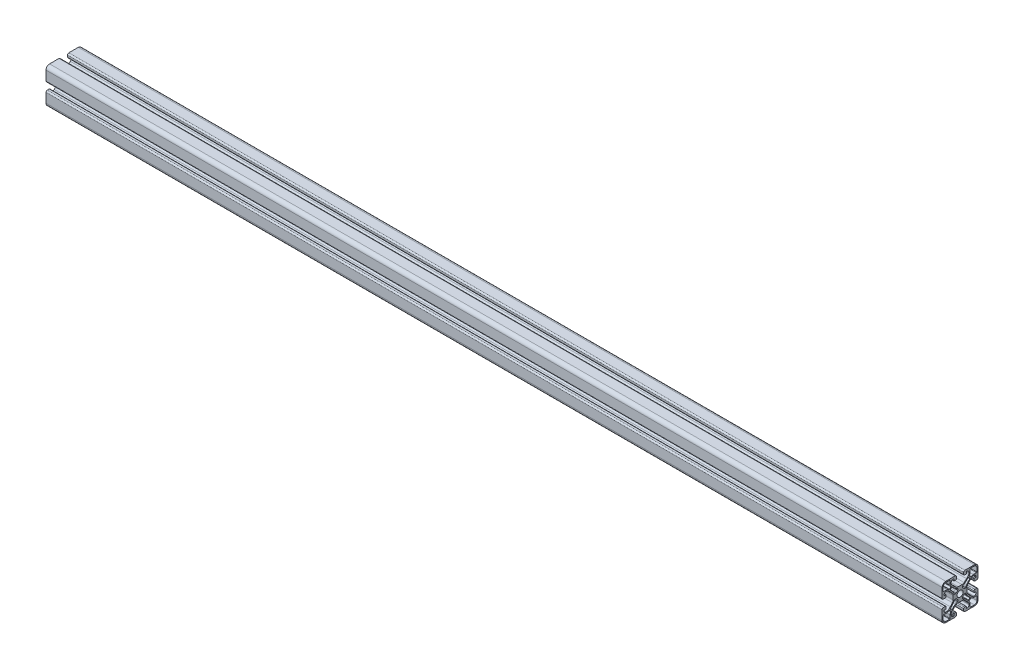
from build123d import *

# Parameters (mm, degrees)
MODEL_R                = 3.4
STRUKTURBAUTEIL1_DEPTH = 1000


with BuildPart() as part:
    # Model → Strukturbauteil1 (new body)
    with BuildSketch(Plane(origin=(0, 0, 0), x_dir=(0, 0, -1), z_dir=(1, 0, 0))):
        with BuildLine():
            Line((14.783583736, 10), (15.5, 10))
            ThreePointArc((15.5, 10), (17.267766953, 9.267766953), (18, 7.5))
            Line((18, 7.5), (18, 7.41))
            ThreePointArc((18, 7.41), (17.87991378, 7.12008622), (17.59, 7))
            Line((17.59, 7), (16, 7))
            ThreePointArc((16, 7), (15.646446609, 6.853553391), (15.5, 6.5))
            Line((15.5, 6.5), (15.5, 5))
            ThreePointArc((15.5, 5), (15.792893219, 4.292893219), (16.5, 4))
            Line((16.5, 4), (18.5, 4))
            ThreePointArc((18.5, 4), (19.560660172, 4.439339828), (20, 5.5))
            Line((20, 5.5), (20, 16))
            ThreePointArc((20, 16), (18.828427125, 18.828427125), (16, 20))
            Line((16, 20), (5.5, 20))
            ThreePointArc((5.5, 20), (4.439339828, 19.560660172), (4, 18.5))
            Line((4, 18.5), (4, 16.5))
            ThreePointArc((4, 16.5), (4.292893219, 15.792893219), (5, 15.5))
            Line((5, 15.5), (6.5, 15.5))
            ThreePointArc((6.5, 15.5), (6.853553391, 15.646446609), (7, 16))
            Line((7, 16), (7, 17.59))
            ThreePointArc((7, 17.59), (7.12008622, 17.87991378), (7.41, 18))
            Line((7.41, 18), (7.5, 18))
            ThreePointArc((7.5, 18), (9.267766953, 17.267766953), (10, 15.5))
            Line((10, 15.5), (10, 14.783583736))
            ThreePointArc((10, 14.783583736), (9.896220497, 14.147700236), (9.595652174, 13.577808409))
            Line((9.595652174, 13.577808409), (7.22489987, 10.870154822))
            Line((7.22489987, 10.870154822), (4.489943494, 8.530952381))
            ThreePointArc((4.489943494, 8.530952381), (3.365314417, 7.950250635), (2.115552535, 7.75))
            Line((2.115552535, 7.75), (-2.115552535, 7.75))
            ThreePointArc((-2.115552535, 7.75), (-3.365314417, 7.950250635), (-4.489943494, 8.530952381))
            Line((-4.489943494, 8.530952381), (-7.22489987, 10.870154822))
            Line((-7.22489987, 10.870154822), (-9.595652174, 13.577808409))
            ThreePointArc((-9.595652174, 13.577808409), (-9.896220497, 14.147700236), (-10, 14.783583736))
            Line((-10, 14.783583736), (-10, 15.5))
            ThreePointArc((-10, 15.5), (-9.267766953, 17.267766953), (-7.5, 18))
            Line((-7.5, 18), (-7.41, 18))
            ThreePointArc((-7.41, 18), (-7.12008622, 17.87991378), (-7, 17.59))
            Line((-7, 17.59), (-7, 16))
            ThreePointArc((-7, 16), (-6.853553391, 15.646446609), (-6.5, 15.5))
            Line((-6.5, 15.5), (-5, 15.5))
            ThreePointArc((-5, 15.5), (-4.292893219, 15.792893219), (-4, 16.5))
            Line((-4, 16.5), (-4, 18.5))
            ThreePointArc((-4, 18.5), (-4.439339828, 19.560660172), (-5.5, 20))
            Line((-5.5, 20), (-16, 20))
            ThreePointArc((-16, 20), (-18.828427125, 18.828427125), (-20, 16))
            Line((-20, 16), (-20, 5.5))
            ThreePointArc((-20, 5.5), (-19.560660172, 4.439339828), (-18.5, 4))
            Line((-18.5, 4), (-16.5, 4))
            ThreePointArc((-16.5, 4), (-15.792893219, 4.292893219), (-15.5, 5))
            Line((-15.5, 5), (-15.5, 6.5))
            ThreePointArc((-15.5, 6.5), (-15.646446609, 6.853553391), (-16, 7))
            Line((-16, 7), (-17.59, 7))
            ThreePointArc((-17.59, 7), (-17.87991378, 7.12008622), (-18, 7.41))
            Line((-18, 7.41), (-18, 7.5))
            ThreePointArc((-18, 7.5), (-17.267766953, 9.267766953), (-15.5, 10))
            Line((-15.5, 10), (-14.783583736, 10))
            ThreePointArc((-14.783583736, 10), (-14.147700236, 9.896220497), (-13.577808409, 9.595652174))
            Line((-13.577808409, 9.595652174), (-10.870154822, 7.22489987))
            Line((-10.870154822, 7.22489987), (-8.530952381, 4.489943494))
            ThreePointArc((-8.530952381, 4.489943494), (-7.950250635, 3.365314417), (-7.75, 2.115552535))
            Line((-7.75, 2.115552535), (-7.75, -2.115552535))
            ThreePointArc((-7.75, -2.115552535), (-7.950250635, -3.365314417), (-8.530952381, -4.489943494))
            Line((-8.530952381, -4.489943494), (-10.870154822, -7.22489987))
            Line((-10.870154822, -7.22489987), (-13.577808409, -9.595652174))
            ThreePointArc((-13.577808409, -9.595652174), (-14.147700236, -9.896220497), (-14.783583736, -10))
            Line((-14.783583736, -10), (-15.5, -10))
            ThreePointArc((-15.5, -10), (-17.267766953, -9.267766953), (-18, -7.5))
            Line((-18, -7.5), (-18, -7.41))
            ThreePointArc((-18, -7.41), (-17.87991378, -7.12008622), (-17.59, -7))
            Line((-17.59, -7), (-16, -7))
            ThreePointArc((-16, -7), (-15.646446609, -6.853553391), (-15.5, -6.5))
            Line((-15.5, -6.5), (-15.5, -5))
            ThreePointArc((-15.5, -5), (-15.792893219, -4.292893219), (-16.5, -4))
            Line((-16.5, -4), (-18.5, -4))
            ThreePointArc((-18.5, -4), (-19.560660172, -4.439339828), (-20, -5.5))
            Line((-20, -5.5), (-20, -16))
            ThreePointArc((-20, -16), (-18.828427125, -18.828427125), (-16, -20))
            Line((-16, -20), (-5.5, -20))
            ThreePointArc((-5.5, -20), (-4.439339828, -19.560660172), (-4, -18.5))
            Line((-4, -18.5), (-4, -16.5))
            ThreePointArc((-4, -16.5), (-4.292893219, -15.792893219), (-5, -15.5))
            Line((-5, -15.5), (-6.5, -15.5))
            ThreePointArc((-6.5, -15.5), (-6.853553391, -15.646446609), (-7, -16))
            Line((-7, -16), (-7, -17.59))
            ThreePointArc((-7, -17.59), (-7.12008622, -17.87991378), (-7.41, -18))
            Line((-7.41, -18), (-7.5, -18))
            ThreePointArc((-7.5, -18), (-9.267766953, -17.267766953), (-10, -15.5))
            Line((-10, -15.5), (-10, -14.783583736))
            ThreePointArc((-10, -14.783583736), (-9.896220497, -14.147700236), (-9.595652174, -13.577808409))
            Line((-9.595652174, -13.577808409), (-7.22489987, -10.870154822))
            Line((-7.22489987, -10.870154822), (-4.489943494, -8.530952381))
            ThreePointArc((-4.489943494, -8.530952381), (-3.365314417, -7.950250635), (-2.115552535, -7.75))
            Line((-2.115552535, -7.75), (2.115552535, -7.75))
            ThreePointArc((2.115552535, -7.75), (3.365314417, -7.950250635), (4.489943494, -8.530952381))
            Line((4.489943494, -8.530952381), (7.22489987, -10.870154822))
            Line((7.22489987, -10.870154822), (9.595652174, -13.577808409))
            ThreePointArc((9.595652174, -13.577808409), (9.896220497, -14.147700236), (10, -14.783583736))
            Line((10, -14.783583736), (10, -15.5))
            ThreePointArc((10, -15.5), (9.267766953, -17.267766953), (7.5, -18))
            Line((7.5, -18), (7.41, -18))
            ThreePointArc((7.41, -18), (7.12008622, -17.87991378), (7, -17.59))
            Line((7, -17.59), (7, -16))
            ThreePointArc((7, -16), (6.853553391, -15.646446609), (6.5, -15.5))
            Line((6.5, -15.5), (5, -15.5))
            ThreePointArc((5, -15.5), (4.292893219, -15.792893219), (4, -16.5))
            Line((4, -16.5), (4, -18.5))
            ThreePointArc((4, -18.5), (4.439339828, -19.560660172), (5.5, -20))
            Line((5.5, -20), (16, -20))
            ThreePointArc((16, -20), (18.828427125, -18.828427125), (20, -16))
            Line((20, -16), (20, -5.5))
            ThreePointArc((20, -5.5), (19.560660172, -4.439339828), (18.5, -4))
            Line((18.5, -4), (16.5, -4))
            ThreePointArc((16.5, -4), (15.792893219, -4.292893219), (15.5, -5))
            Line((15.5, -5), (15.5, -6.5))
            ThreePointArc((15.5, -6.5), (15.646446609, -6.853553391), (16, -7))
            Line((16, -7), (17.59, -7))
            ThreePointArc((17.59, -7), (17.87991378, -7.12008622), (18, -7.41))
            Line((18, -7.41), (18, -7.5))
            ThreePointArc((18, -7.5), (17.267766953, -9.267766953), (15.5, -10))
            Line((15.5, -10), (14.783583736, -10))
            ThreePointArc((14.783583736, -10), (14.147700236, -9.896220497), (13.577808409, -9.595652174))
            Line((13.577808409, -9.595652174), (10.870154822, -7.22489987))
            Line((10.870154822, -7.22489987), (8.530952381, -4.489943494))
            ThreePointArc((8.530952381, -4.489943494), (7.950250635, -3.365314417), (7.75, -2.115552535))
            Line((7.75, -2.115552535), (7.75, 2.115552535))
            ThreePointArc((7.75, 2.115552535), (7.950250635, 3.365314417), (8.530952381, 4.489943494))
            Line((8.530952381, 4.489943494), (10.870154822, 7.22489987))
            Line((10.870154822, 7.22489987), (13.577808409, 9.595652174))
            ThreePointArc((13.577808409, 9.595652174), (14.147700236, 9.896220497), (14.783583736, 10))
        make_face()
        Circle(MODEL_R, mode=Mode.SUBTRACT)
        with BuildLine():
            Line((6.119036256, 2.5), (4.609772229, 2.5))
            ThreePointArc((4.609772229, 2.5), (4.371406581, 2.560475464), (4.190702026, 2.727272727))
            Line((4.190702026, 2.727272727), (3.535533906, 3.535533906))
            Line((3.535533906, 3.535533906), (2.727272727, 4.190702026))
            ThreePointArc((2.727272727, 4.190702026), (2.560475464, 4.371406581), (2.5, 4.609772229))
            Line((2.5, 4.609772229), (2.5, 6.119036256))
            ThreePointArc((2.5, 6.119036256), (2.620005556, 6.444004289), (2.922416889, 6.612980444))
            Line((2.922416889, 6.612980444), (4.119717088, 6.951737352))
            Line((4.119717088, 6.951737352), (5.202260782, 7.565238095))
            Line((5.202260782, 7.565238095), (7.09151636, 9.099206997))
            Line((7.09151636, 9.099206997), (8.830293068, 10.801852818))
            ThreePointArc((8.830293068, 10.801852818), (9.187339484, 10.961158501), (9.549882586, 10.814792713))
            Line((9.549882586, 10.814792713), (10.814792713, 9.549882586))
            ThreePointArc((10.814792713, 9.549882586), (10.961158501, 9.187339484), (10.801852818, 8.830293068))
            Line((10.801852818, 8.830293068), (9.099206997, 7.09151636))
            Line((9.099206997, 7.09151636), (7.565238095, 5.202260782))
            Line((7.565238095, 5.202260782), (6.951737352, 4.119717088))
            Line((6.951737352, 4.119717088), (6.612980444, 2.922416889))
            ThreePointArc((6.612980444, 2.922416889), (6.444004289, 2.620005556), (6.119036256, 2.5))
        make_face(mode=Mode.SUBTRACT)
        with BuildLine():
            Line((18.8, 16), (18.8, 11.7))
            ThreePointArc((18.8, 11.7), (18.653553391, 11.346446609), (18.3, 11.2))
            Line((18.3, 11.2), (14.783583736, 11.2))
            ThreePointArc((14.783583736, 11.2), (13.766170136, 11.033952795), (12.854343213, 10.553043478))
            Line((12.854343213, 10.553043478), (12.446581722, 10.238570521))
            ThreePointArc((12.446581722, 10.238570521), (12.10771655, 10.132361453), (11.783802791, 10.277928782))
            Line((11.783802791, 10.277928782), (10.277928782, 11.783802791))
            ThreePointArc((10.277928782, 11.783802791), (10.132361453, 12.10771655), (10.238570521, 12.446581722))
            Line((10.238570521, 12.446581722), (10.553043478, 12.854343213))
            ThreePointArc((10.553043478, 12.854343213), (11.033952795, 13.766170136), (11.2, 14.783583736))
            Line((11.2, 14.783583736), (11.2, 18.3))
            ThreePointArc((11.2, 18.3), (11.346446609, 18.653553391), (11.7, 18.8))
            Line((11.7, 18.8), (16, 18.8))
            ThreePointArc((16, 18.8), (17.979898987, 17.979898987), (18.8, 16))
        make_face(mode=Mode.SUBTRACT)
        with BuildLine():
            Line((-2.5, 6.119036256), (-2.5, 4.609772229))
            ThreePointArc((-2.5, 4.609772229), (-2.560475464, 4.371406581), (-2.727272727, 4.190702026))
            Line((-2.727272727, 4.190702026), (-3.535533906, 3.535533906))
            Line((-3.535533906, 3.535533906), (-4.190702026, 2.727272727))
            ThreePointArc((-4.190702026, 2.727272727), (-4.371406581, 2.560475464), (-4.609772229, 2.5))
            Line((-4.609772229, 2.5), (-6.119036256, 2.5))
            ThreePointArc((-6.119036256, 2.5), (-6.444004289, 2.620005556), (-6.612980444, 2.922416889))
            Line((-6.612980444, 2.922416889), (-6.951737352, 4.119717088))
            Line((-6.951737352, 4.119717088), (-7.565238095, 5.202260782))
            Line((-7.565238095, 5.202260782), (-9.099206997, 7.09151636))
            Line((-9.099206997, 7.09151636), (-10.801852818, 8.830293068))
            ThreePointArc((-10.801852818, 8.830293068), (-10.961158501, 9.187339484), (-10.814792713, 9.549882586))
            Line((-10.814792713, 9.549882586), (-9.549882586, 10.814792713))
            ThreePointArc((-9.549882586, 10.814792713), (-9.187339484, 10.961158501), (-8.830293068, 10.801852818))
            Line((-8.830293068, 10.801852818), (-7.09151636, 9.099206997))
            Line((-7.09151636, 9.099206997), (-5.202260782, 7.565238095))
            Line((-5.202260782, 7.565238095), (-4.119717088, 6.951737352))
            Line((-4.119717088, 6.951737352), (-2.922416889, 6.612980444))
            ThreePointArc((-2.922416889, 6.612980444), (-2.620005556, 6.444004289), (-2.5, 6.119036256))
        make_face(mode=Mode.SUBTRACT)
        with BuildLine():
            Line((-16, 18.8), (-11.7, 18.8))
            ThreePointArc((-11.7, 18.8), (-11.346446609, 18.653553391), (-11.2, 18.3))
            Line((-11.2, 18.3), (-11.2, 14.783583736))
            ThreePointArc((-11.2, 14.783583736), (-11.033952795, 13.766170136), (-10.553043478, 12.854343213))
            Line((-10.553043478, 12.854343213), (-10.238570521, 12.446581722))
            ThreePointArc((-10.238570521, 12.446581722), (-10.132361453, 12.10771655), (-10.277928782, 11.783802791))
            Line((-10.277928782, 11.783802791), (-11.783802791, 10.277928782))
            ThreePointArc((-11.783802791, 10.277928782), (-12.10771655, 10.132361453), (-12.446581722, 10.238570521))
            Line((-12.446581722, 10.238570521), (-12.854343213, 10.553043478))
            ThreePointArc((-12.854343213, 10.553043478), (-13.766170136, 11.033952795), (-14.783583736, 11.2))
            Line((-14.783583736, 11.2), (-18.3, 11.2))
            ThreePointArc((-18.3, 11.2), (-18.653553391, 11.346446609), (-18.8, 11.7))
            Line((-18.8, 11.7), (-18.8, 16))
            ThreePointArc((-18.8, 16), (-17.979898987, 17.979898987), (-16, 18.8))
        make_face(mode=Mode.SUBTRACT)
        with BuildLine():
            Line((2.5, -6.119036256), (2.5, -4.609772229))
            ThreePointArc((2.5, -4.609772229), (2.560475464, -4.371406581), (2.727272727, -4.190702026))
            Line((2.727272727, -4.190702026), (3.535533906, -3.535533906))
            Line((3.535533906, -3.535533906), (4.190702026, -2.727272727))
            ThreePointArc((4.190702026, -2.727272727), (4.371406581, -2.560475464), (4.609772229, -2.5))
            Line((4.609772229, -2.5), (6.119036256, -2.5))
            ThreePointArc((6.119036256, -2.5), (6.444004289, -2.620005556), (6.612980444, -2.922416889))
            Line((6.612980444, -2.922416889), (6.951737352, -4.119717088))
            Line((6.951737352, -4.119717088), (7.565238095, -5.202260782))
            Line((7.565238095, -5.202260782), (9.099206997, -7.09151636))
            Line((9.099206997, -7.09151636), (10.801852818, -8.830293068))
            ThreePointArc((10.801852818, -8.830293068), (10.961158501, -9.187339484), (10.814792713, -9.549882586))
            Line((10.814792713, -9.549882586), (9.549882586, -10.814792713))
            ThreePointArc((9.549882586, -10.814792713), (9.187339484, -10.961158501), (8.830293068, -10.801852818))
            Line((8.830293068, -10.801852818), (7.09151636, -9.099206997))
            Line((7.09151636, -9.099206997), (5.202260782, -7.565238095))
            Line((5.202260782, -7.565238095), (4.119717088, -6.951737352))
            Line((4.119717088, -6.951737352), (2.922416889, -6.612980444))
            ThreePointArc((2.922416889, -6.612980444), (2.620005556, -6.444004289), (2.5, -6.119036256))
        make_face(mode=Mode.SUBTRACT)
        with BuildLine():
            Line((16, -18.8), (11.7, -18.8))
            ThreePointArc((11.7, -18.8), (11.346446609, -18.653553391), (11.2, -18.3))
            Line((11.2, -18.3), (11.2, -14.783583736))
            ThreePointArc((11.2, -14.783583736), (11.033952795, -13.766170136), (10.553043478, -12.854343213))
            Line((10.553043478, -12.854343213), (10.238570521, -12.446581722))
            ThreePointArc((10.238570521, -12.446581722), (10.132361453, -12.10771655), (10.277928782, -11.783802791))
            Line((10.277928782, -11.783802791), (11.783802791, -10.277928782))
            ThreePointArc((11.783802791, -10.277928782), (12.10771655, -10.132361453), (12.446581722, -10.238570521))
            Line((12.446581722, -10.238570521), (12.854343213, -10.553043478))
            ThreePointArc((12.854343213, -10.553043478), (13.766170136, -11.033952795), (14.783583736, -11.2))
            Line((14.783583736, -11.2), (18.3, -11.2))
            ThreePointArc((18.3, -11.2), (18.653553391, -11.346446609), (18.8, -11.7))
            Line((18.8, -11.7), (18.8, -16))
            ThreePointArc((18.8, -16), (17.979898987, -17.979898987), (16, -18.8))
        make_face(mode=Mode.SUBTRACT)
        with BuildLine():
            Line((-6.119036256, -2.5), (-4.609772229, -2.5))
            ThreePointArc((-4.609772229, -2.5), (-4.371406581, -2.560475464), (-4.190702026, -2.727272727))
            Line((-4.190702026, -2.727272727), (-3.535533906, -3.535533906))
            Line((-3.535533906, -3.535533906), (-2.727272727, -4.190702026))
            ThreePointArc((-2.727272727, -4.190702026), (-2.560475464, -4.371406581), (-2.5, -4.609772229))
            Line((-2.5, -4.609772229), (-2.5, -6.119036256))
            ThreePointArc((-2.5, -6.119036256), (-2.620005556, -6.444004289), (-2.922416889, -6.612980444))
            Line((-2.922416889, -6.612980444), (-4.119717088, -6.951737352))
            Line((-4.119717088, -6.951737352), (-5.202260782, -7.565238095))
            Line((-5.202260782, -7.565238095), (-7.09151636, -9.099206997))
            Line((-7.09151636, -9.099206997), (-8.830293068, -10.801852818))
            ThreePointArc((-8.830293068, -10.801852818), (-9.187339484, -10.961158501), (-9.549882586, -10.814792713))
            Line((-9.549882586, -10.814792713), (-10.814792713, -9.549882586))
            ThreePointArc((-10.814792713, -9.549882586), (-10.961158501, -9.187339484), (-10.801852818, -8.830293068))
            Line((-10.801852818, -8.830293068), (-9.099206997, -7.09151636))
            Line((-9.099206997, -7.09151636), (-7.565238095, -5.202260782))
            Line((-7.565238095, -5.202260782), (-6.951737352, -4.119717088))
            Line((-6.951737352, -4.119717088), (-6.612980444, -2.922416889))
            ThreePointArc((-6.612980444, -2.922416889), (-6.444004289, -2.620005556), (-6.119036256, -2.5))
        make_face(mode=Mode.SUBTRACT)
        with BuildLine():
            Line((-18.8, -16), (-18.8, -11.7))
            ThreePointArc((-18.8, -11.7), (-18.653553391, -11.346446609), (-18.3, -11.2))
            Line((-18.3, -11.2), (-14.783583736, -11.2))
            ThreePointArc((-14.783583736, -11.2), (-13.766170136, -11.033952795), (-12.854343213, -10.553043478))
            Line((-12.854343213, -10.553043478), (-12.446581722, -10.238570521))
            ThreePointArc((-12.446581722, -10.238570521), (-12.10771655, -10.132361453), (-11.783802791, -10.277928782))
            Line((-11.783802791, -10.277928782), (-10.277928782, -11.783802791))
            ThreePointArc((-10.277928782, -11.783802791), (-10.132361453, -12.10771655), (-10.238570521, -12.446581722))
            Line((-10.238570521, -12.446581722), (-10.553043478, -12.854343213))
            ThreePointArc((-10.553043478, -12.854343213), (-11.033952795, -13.766170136), (-11.2, -14.783583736))
            Line((-11.2, -14.783583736), (-11.2, -18.3))
            ThreePointArc((-11.2, -18.3), (-11.346446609, -18.653553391), (-11.7, -18.8))
            Line((-11.7, -18.8), (-16, -18.8))
            ThreePointArc((-16, -18.8), (-17.979898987, -17.979898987), (-18.8, -16))
        make_face(mode=Mode.SUBTRACT)
    extrude(amount=STRUKTURBAUTEIL1_DEPTH)


solid = part.part
